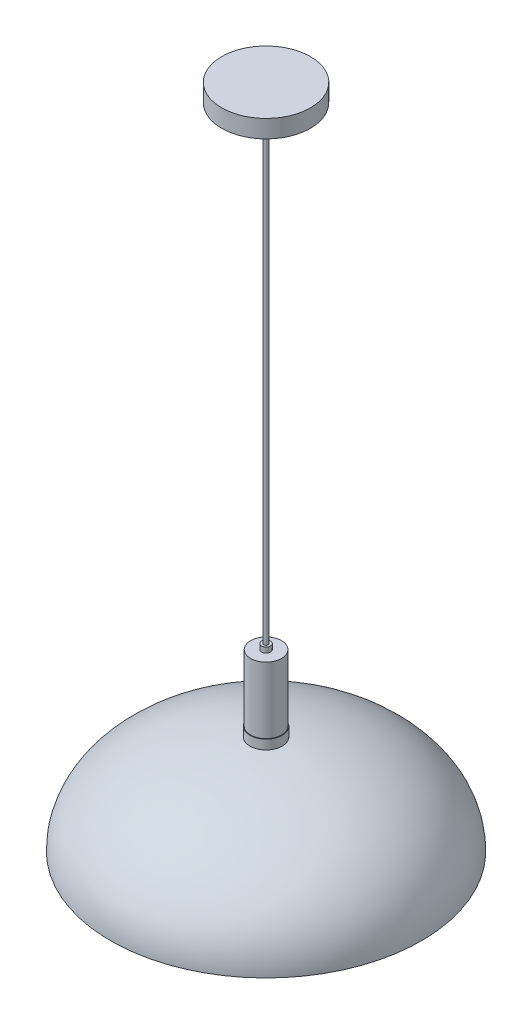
ISO-10303-21;
HEADER;
FILE_DESCRIPTION(('STEP AP214'),'2;1');
FILE_NAME('part.step','',(''),(''),'','','');
FILE_SCHEMA(('AUTOMOTIVE_DESIGN { 1 0 10303 214 1 1 1 1 }'));
ENDSEC;
DATA;
#1=APPLICATION_CONTEXT('core data for automotive mechanical design processes');
#2=APPLICATION_PROTOCOL_DEFINITION('international standard','automotive_design',2000,#1);
#3=PRODUCT_CONTEXT('',#1,'mechanical');
#4=PRODUCT('Part','Part','',(#3));
#5=PRODUCT_RELATED_PRODUCT_CATEGORY('part','',(#4));
#6=PRODUCT_DEFINITION_FORMATION('','',#4);
#7=PRODUCT_DEFINITION_CONTEXT('part definition',#1,'design');
#8=PRODUCT_DEFINITION('design','',#6,#7);
#9=PRODUCT_DEFINITION_SHAPE('','',#8);
#10=(LENGTH_UNIT() NAMED_UNIT(*) SI_UNIT(.MILLI.,.METRE.));
#11=(NAMED_UNIT(*) PLANE_ANGLE_UNIT() SI_UNIT($,.RADIAN.));
#12=(NAMED_UNIT(*) SI_UNIT($,.STERADIAN.) SOLID_ANGLE_UNIT());
#13=UNCERTAINTY_MEASURE_WITH_UNIT(LENGTH_MEASURE(1.E-05),#10,'distance_accuracy_value','');
#14=(GEOMETRIC_REPRESENTATION_CONTEXT(3) GLOBAL_UNCERTAINTY_ASSIGNED_CONTEXT((#13)) GLOBAL_UNIT_ASSIGNED_CONTEXT((#10,
#11,#12)) REPRESENTATION_CONTEXT('',''));
#15=CARTESIAN_POINT('',(0.,0.,0.));
#16=DIRECTION('',(0.,0.,1.));
#17=DIRECTION('',(1.,0.,0.));
#18=AXIS2_PLACEMENT_3D('',#15,#16,#17);
#19=CARTESIAN_POINT('',(0.,0.,0.));
#20=DIRECTION('',(0.,-1.,0.));
#21=DIRECTION('',(0.,0.,-1.));
#22=AXIS2_PLACEMENT_3D('',#19,#20,#21);
#23=PLANE('',#22);
#24=CARTESIAN_POINT('',(0.,0.,0.));
#25=DIRECTION('',(0.,-1.,0.));
#26=DIRECTION('',(0.,0.,-1.));
#27=AXIS2_PLACEMENT_3D('',#24,#25,#26);
#28=CIRCLE('',#27,172.);
#29=CARTESIAN_POINT('',(0.,0.,-172.));
#30=VERTEX_POINT('',#29);
#31=EDGE_CURVE('E94',#30,#30,#28,.T.);
#32=ORIENTED_EDGE('',*,*,#31,.F.);
#33=EDGE_LOOP('',(#32));
#34=FACE_BOUND('',#33,.T.);
#35=CARTESIAN_POINT('',(0.,0.,0.));
#36=DIRECTION('',(0.,-1.,0.));
#37=DIRECTION('',(0.,0.,-1.));
#38=AXIS2_PLACEMENT_3D('',#35,#36,#37);
#39=CIRCLE('',#38,175.);
#40=CARTESIAN_POINT('',(0.,0.,-175.));
#41=VERTEX_POINT('',#40);
#42=EDGE_CURVE('E85',#41,#41,#39,.T.);
#43=ORIENTED_EDGE('',*,*,#42,.T.);
#44=EDGE_LOOP('',(#43));
#45=FACE_BOUND('',#44,.T.);
#46=ADVANCED_FACE('F38',(#34,#45),#23,.T.);
#47=CARTESIAN_POINT('',(0.,750.,0.));
#48=DIRECTION('',(0.,1.,0.));
#49=DIRECTION('',(0.,0.,1.));
#50=AXIS2_PLACEMENT_3D('',#47,#48,#49);
#51=PLANE('',#50);
#52=CARTESIAN_POINT('',(0.,750.,0.));
#53=DIRECTION('',(0.,-1.,0.));
#54=DIRECTION('',(0.,0.,-1.));
#55=AXIS2_PLACEMENT_3D('',#52,#53,#54);
#56=CIRCLE('',#55,50.);
#57=CARTESIAN_POINT('',(0.,750.,-50.));
#58=VERTEX_POINT('',#57);
#59=EDGE_CURVE('E10',#58,#58,#56,.T.);
#60=ORIENTED_EDGE('',*,*,#59,.F.);
#61=EDGE_LOOP('',(#60));
#62=FACE_BOUND('',#61,.T.);
#63=ADVANCED_FACE('F141',(#62),#51,.T.);
#64=CARTESIAN_POINT('',(0.,0.,0.));
#65=DIRECTION('',(0.,-1.,0.));
#66=DIRECTION('',(0.,0.,-1.));
#67=AXIS2_PLACEMENT_3D('',#64,#65,#66);
#68=CYLINDRICAL_SURFACE('',#67,50.);
#69=ORIENTED_EDGE('',*,*,#59,.T.);
#70=EDGE_LOOP('',(#69));
#71=FACE_BOUND('',#70,.T.);
#72=CARTESIAN_POINT('',(0.,730.,0.));
#73=DIRECTION('',(0.,-1.,0.));
#74=DIRECTION('',(0.,0.,-1.));
#75=AXIS2_PLACEMENT_3D('',#72,#73,#74);
#76=CIRCLE('',#75,50.);
#77=CARTESIAN_POINT('',(0.,730.,-50.));
#78=VERTEX_POINT('',#77);
#79=EDGE_CURVE('E45',#78,#78,#76,.T.);
#80=ORIENTED_EDGE('',*,*,#79,.F.);
#81=EDGE_LOOP('',(#80));
#82=FACE_BOUND('',#81,.T.);
#83=ADVANCED_FACE('F139',(#71,#82),#68,.T.);
#84=CARTESIAN_POINT('',(2.500000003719,730.,0.));
#85=DIRECTION('',(0.,-1.,0.));
#86=DIRECTION('',(0.,0.,-1.));
#87=AXIS2_PLACEMENT_3D('',#84,#85,#86);
#88=PLANE('',#87);
#89=ORIENTED_EDGE('',*,*,#79,.T.);
#90=EDGE_LOOP('',(#89));
#91=FACE_BOUND('',#90,.T.);
#92=CARTESIAN_POINT('',(0.,730.,0.));
#93=DIRECTION('',(0.,-1.,0.));
#94=DIRECTION('',(0.,0.,-1.));
#95=AXIS2_PLACEMENT_3D('',#92,#93,#94);
#96=CIRCLE('',#95,2.500000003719);
#97=CARTESIAN_POINT('',(0.,730.,-2.500000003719));
#98=VERTEX_POINT('',#97);
#99=EDGE_CURVE('E50',#98,#98,#96,.T.);
#100=ORIENTED_EDGE('',*,*,#99,.F.);
#101=EDGE_LOOP('',(#100));
#102=FACE_BOUND('',#101,.T.);
#103=ADVANCED_FACE('F135',(#91,#102),#88,.T.);
#104=CARTESIAN_POINT('',(0.,0.,0.));
#105=DIRECTION('',(0.,-1.,0.));
#106=DIRECTION('',(0.,0.,-1.));
#107=AXIS2_PLACEMENT_3D('',#104,#105,#106);
#108=CYLINDRICAL_SURFACE('',#107,2.500000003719);
#109=ORIENTED_EDGE('',*,*,#99,.T.);
#110=EDGE_LOOP('',(#109));
#111=FACE_BOUND('',#110,.T.);
#112=CARTESIAN_POINT('',(0.,202.541423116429,0.));
#113=DIRECTION('',(0.,-1.,0.));
#114=DIRECTION('',(0.,0.,-1.));
#115=AXIS2_PLACEMENT_3D('',#112,#113,#114);
#116=CIRCLE('',#115,2.500000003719);
#117=CARTESIAN_POINT('',(0.,202.541423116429,-2.500000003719));
#118=VERTEX_POINT('',#117);
#119=EDGE_CURVE('E55',#118,#118,#116,.T.);
#120=ORIENTED_EDGE('',*,*,#119,.F.);
#121=EDGE_LOOP('',(#120));
#122=FACE_BOUND('',#121,.T.);
#123=ADVANCED_FACE('F131',(#111,#122),#108,.T.);
#124=CARTESIAN_POINT('',(5.000000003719,202.541423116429,0.));
#125=DIRECTION('',(0.,1.,0.));
#126=DIRECTION('',(0.,0.,1.));
#127=AXIS2_PLACEMENT_3D('',#124,#125,#126);
#128=PLANE('',#127);
#129=ORIENTED_EDGE('',*,*,#119,.T.);
#130=EDGE_LOOP('',(#129));
#131=FACE_BOUND('',#130,.T.);
#132=CARTESIAN_POINT('',(0.,202.541423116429,0.));
#133=DIRECTION('',(0.,-1.,0.));
#134=DIRECTION('',(0.,0.,-1.));
#135=AXIS2_PLACEMENT_3D('',#132,#133,#134);
#136=CIRCLE('',#135,5.000000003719);
#137=CARTESIAN_POINT('',(0.,202.541423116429,-5.000000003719));
#138=VERTEX_POINT('',#137);
#139=EDGE_CURVE('E61',#138,#138,#136,.T.);
#140=ORIENTED_EDGE('',*,*,#139,.F.);
#141=EDGE_LOOP('',(#140));
#142=FACE_BOUND('',#141,.T.);
#143=ADVANCED_FACE('F127',(#131,#142),#128,.T.);
#144=CARTESIAN_POINT('',(0.,0.,0.));
#145=DIRECTION('',(0.,-1.,0.));
#146=DIRECTION('',(0.,0.,-1.));
#147=AXIS2_PLACEMENT_3D('',#144,#145,#146);
#148=CYLINDRICAL_SURFACE('',#147,5.000000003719);
#149=ORIENTED_EDGE('',*,*,#139,.T.);
#150=EDGE_LOOP('',(#149));
#151=FACE_BOUND('',#150,.T.);
#152=CARTESIAN_POINT('',(0.,196.639402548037,0.));
#153=DIRECTION('',(0.,-1.,0.));
#154=DIRECTION('',(0.,0.,-1.));
#155=AXIS2_PLACEMENT_3D('',#152,#153,#154);
#156=CIRCLE('',#155,5.000000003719);
#157=CARTESIAN_POINT('',(0.,196.639402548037,-5.000000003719));
#158=VERTEX_POINT('',#157);
#159=EDGE_CURVE('E65',#158,#158,#156,.T.);
#160=ORIENTED_EDGE('',*,*,#159,.F.);
#161=EDGE_LOOP('',(#160));
#162=FACE_BOUND('',#161,.T.);
#163=ADVANCED_FACE('F123',(#151,#162),#148,.T.);
#164=CARTESIAN_POINT('',(5.000000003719,196.639402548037,0.));
#165=DIRECTION('',(0.,1.,0.));
#166=DIRECTION('',(0.,0.,1.));
#167=AXIS2_PLACEMENT_3D('',#164,#165,#166);
#168=PLANE('',#167);
#169=ORIENTED_EDGE('',*,*,#159,.T.);
#170=EDGE_LOOP('',(#169));
#171=FACE_BOUND('',#170,.T.);
#172=CARTESIAN_POINT('',(0.,196.639402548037,0.));
#173=DIRECTION('',(0.,-1.,0.));
#174=DIRECTION('',(0.,0.,-1.));
#175=AXIS2_PLACEMENT_3D('',#172,#173,#174);
#176=CIRCLE('',#175,17.4059828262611);
#177=CARTESIAN_POINT('',(0.,196.639402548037,-17.4059828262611));
#178=VERTEX_POINT('',#177);
#179=EDGE_CURVE('E69',#178,#178,#176,.T.);
#180=ORIENTED_EDGE('',*,*,#179,.F.);
#181=EDGE_LOOP('',(#180));
#182=FACE_BOUND('',#181,.T.);
#183=ADVANCED_FACE('F119',(#171,#182),#168,.T.);
#184=CARTESIAN_POINT('',(0.,0.,0.));
#185=DIRECTION('',(0.,-1.,0.));
#186=DIRECTION('',(0.,0.,-1.));
#187=AXIS2_PLACEMENT_3D('',#184,#185,#186);
#188=CYLINDRICAL_SURFACE('',#187,17.4059828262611);
#189=ORIENTED_EDGE('',*,*,#179,.T.);
#190=EDGE_LOOP('',(#189));
#191=FACE_BOUND('',#190,.T.);
#192=CARTESIAN_POINT('',(0.,122.002230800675,0.));
#193=DIRECTION('',(0.,-1.,0.));
#194=DIRECTION('',(0.,0.,-1.));
#195=AXIS2_PLACEMENT_3D('',#192,#193,#194);
#196=CIRCLE('',#195,17.4059828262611);
#197=CARTESIAN_POINT('',(0.,122.002230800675,-17.4059828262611));
#198=VERTEX_POINT('',#197);
#199=EDGE_CURVE('E73',#198,#198,#196,.T.);
#200=ORIENTED_EDGE('',*,*,#199,.F.);
#201=EDGE_LOOP('',(#200));
#202=FACE_BOUND('',#201,.T.);
#203=ADVANCED_FACE('F115',(#191,#202),#188,.T.);
#204=CARTESIAN_POINT('',(17.4059828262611,122.002230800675,0.));
#205=DIRECTION('',(0.,1.,0.));
#206=DIRECTION('',(0.,0.,1.));
#207=AXIS2_PLACEMENT_3D('',#204,#205,#206);
#208=PLANE('',#207);
#209=ORIENTED_EDGE('',*,*,#199,.T.);
#210=EDGE_LOOP('',(#209));
#211=FACE_BOUND('',#210,.T.);
#212=CARTESIAN_POINT('',(0.,122.002230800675,0.));
#213=DIRECTION('',(0.,-1.,0.));
#214=DIRECTION('',(0.,0.,-1.));
#215=AXIS2_PLACEMENT_3D('',#212,#213,#214);
#216=CIRCLE('',#215,18.1246827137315);
#217=CARTESIAN_POINT('',(0.,122.002230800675,-18.1246827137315));
#218=VERTEX_POINT('',#217);
#219=EDGE_CURVE('E77',#218,#218,#216,.T.);
#220=ORIENTED_EDGE('',*,*,#219,.F.);
#221=EDGE_LOOP('',(#220));
#222=FACE_BOUND('',#221,.T.);
#223=ADVANCED_FACE('F111',(#211,#222),#208,.T.);
#224=CARTESIAN_POINT('',(0.,0.,0.));
#225=DIRECTION('',(0.,-1.,0.));
#226=DIRECTION('',(0.,0.,-1.));
#227=AXIS2_PLACEMENT_3D('',#224,#225,#226);
#228=CYLINDRICAL_SURFACE('',#227,18.1246827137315);
#229=ORIENTED_EDGE('',*,*,#219,.T.);
#230=EDGE_LOOP('',(#229));
#231=FACE_BOUND('',#230,.T.);
#232=CARTESIAN_POINT('',(0.,111.455132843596,0.));
#233=DIRECTION('',(0.,-1.,0.));
#234=DIRECTION('',(0.,0.,-1.));
#235=AXIS2_PLACEMENT_3D('',#232,#233,#234);
#236=CIRCLE('',#235,18.1246827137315);
#237=CARTESIAN_POINT('',(0.,111.455132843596,-18.1246827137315));
#238=VERTEX_POINT('',#237);
#239=EDGE_CURVE('E81',#238,#238,#236,.T.);
#240=ORIENTED_EDGE('',*,*,#239,.F.);
#241=EDGE_LOOP('',(#240));
#242=FACE_BOUND('',#241,.T.);
#243=ADVANCED_FACE('F106',(#231,#242),#228,.T.);
#244=CARTESIAN_POINT('',(175.,0.,0.));
#245=CARTESIAN_POINT('',(175.,55.0246886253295,0.));
#246=CARTESIAN_POINT('',(120.313960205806,94.2682568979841,0.));
#247=CARTESIAN_POINT('',(61.4770682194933,108.343218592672,0.));
#248=CARTESIAN_POINT('',(18.1246827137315,111.455132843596,0.));
#249=CARTESIAN_POINT('',(17.4283809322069,111.505114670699,0.));
#250=CARTESIAN_POINT('',(16.7320791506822,111.555096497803,0.));
#251=CARTESIAN_POINT('',(16.0357773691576,111.605078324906,0.));
#252=CARTESIAN_POINT('',(15.339475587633,111.65506015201,0.));
#253=B_SPLINE_CURVE_WITH_KNOTS('',4,(#244,#245,#246,#247,#248,#249,#250,#251,#252),
.UNSPECIFIED.,.F.,.F.,(5,4,5),(0.,1.,1.0160614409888),.UNSPECIFIED.);
#254=CARTESIAN_POINT('',(0.,0.,0.));
#255=DIRECTION('',(0.,-1.,0.));
#256=AXIS1_PLACEMENT('',#254,#255);
#257=SURFACE_OF_REVOLUTION('',#253,#256);
#258=ORIENTED_EDGE('',*,*,#239,.T.);
#259=EDGE_LOOP('',(#258));
#260=FACE_BOUND('',#259,.T.);
#261=ORIENTED_EDGE('',*,*,#42,.F.);
#262=EDGE_LOOP('',(#261));
#263=FACE_BOUND('',#262,.T.);
#264=ADVANCED_FACE('F100',(#260,#263),#257,.F.);
#265=CARTESIAN_POINT('',(175.,0.,0.));
#266=CARTESIAN_POINT('',(175.,55.0246886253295,0.));
#267=CARTESIAN_POINT('',(120.313960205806,94.2682568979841,0.));
#268=CARTESIAN_POINT('',(61.4770682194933,108.343218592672,0.));
#269=CARTESIAN_POINT('',(17.4283809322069,111.505114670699,0.));
#270=CARTESIAN_POINT('',(16.7320791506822,111.555096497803,0.));
#271=CARTESIAN_POINT('',(16.0357773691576,111.605078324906,0.));
#272=CARTESIAN_POINT('',(15.339475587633,111.65506015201,0.));
#273=B_SPLINE_CURVE_WITH_KNOTS('',4,(#265,#266,#267,#268,#269,#270,#271,#272),.UNSPECIFIED.,.F.,
.F.,(5,3,5),(0.,1.,1.0160614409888),.UNSPECIFIED.);
#274=CARTESIAN_POINT('',(0.,0.,0.));
#275=DIRECTION('',(0.,-1.,0.));
#276=AXIS1_PLACEMENT('',#274,#275);
#277=SURFACE_OF_REVOLUTION('',#273,#276);
#278=OFFSET_SURFACE('',#277,3.,.F.);
#279=CARTESIAN_POINT('',(0.,108.662759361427,0.));
#280=DIRECTION('',(0.,-1.,0.));
#281=DIRECTION('',(0.,0.,-1.));
#282=AXIS2_PLACEMENT_3D('',#279,#280,#281);
#283=CIRCLE('',#282,15.1246827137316);
#284=CARTESIAN_POINT('',(0.,108.662759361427,-15.1246827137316));
#285=VERTEX_POINT('',#284);
#286=EDGE_CURVE('E157',#285,#285,#283,.T.);
#287=ORIENTED_EDGE('',*,*,#286,.F.);
#288=EDGE_LOOP('',(#287));
#289=FACE_BOUND('',#288,.T.);
#290=ORIENTED_EDGE('',*,*,#31,.T.);
#291=EDGE_LOOP('',(#290));
#292=FACE_BOUND('',#291,.T.);
#293=ADVANCED_FACE('F105',(#289,#292),#278,.T.);
#294=CARTESIAN_POINT('',(0.,0.,0.));
#295=DIRECTION('',(0.,-1.,0.));
#296=DIRECTION('',(0.,0.,-1.));
#297=AXIS2_PLACEMENT_3D('',#294,#295,#296);
#298=CYLINDRICAL_SURFACE('',#297,15.1246827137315);
#299=CARTESIAN_POINT('',(0.,119.002230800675,0.));
#300=DIRECTION('',(0.,1.,0.));
#301=DIRECTION('',(0.,0.,1.));
#302=AXIS2_PLACEMENT_3D('',#299,#300,#301);
#303=CIRCLE('',#302,15.1246827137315);
#304=CARTESIAN_POINT('',(0.,119.002230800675,15.1246827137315));
#305=VERTEX_POINT('',#304);
#306=EDGE_CURVE('E160',#305,#305,#303,.F.);
#307=ORIENTED_EDGE('',*,*,#306,.F.);
#308=EDGE_LOOP('',(#307));
#309=FACE_BOUND('',#308,.T.);
#310=ORIENTED_EDGE('',*,*,#286,.T.);
#311=EDGE_LOOP('',(#310));
#312=FACE_BOUND('',#311,.T.);
#313=ADVANCED_FACE('F269',(#309,#312),#298,.F.);
#314=CARTESIAN_POINT('',(17.4059828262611,119.002230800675,0.));
#315=DIRECTION('',(0.,1.,0.));
#316=DIRECTION('',(0.,0.,1.));
#317=AXIS2_PLACEMENT_3D('',#314,#315,#316);
#318=PLANE('',#317);
#319=CARTESIAN_POINT('',(0.,119.002230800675,0.));
#320=DIRECTION('',(0.,1.,0.));
#321=DIRECTION('',(0.,0.,1.));
#322=AXIS2_PLACEMENT_3D('',#319,#320,#321);
#323=CIRCLE('',#322,14.4059828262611);
#324=CARTESIAN_POINT('',(0.,119.002230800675,14.4059828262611));
#325=VERTEX_POINT('',#324);
#326=EDGE_CURVE('E165',#325,#325,#323,.F.);
#327=ORIENTED_EDGE('',*,*,#326,.F.);
#328=EDGE_LOOP('',(#327));
#329=FACE_BOUND('',#328,.T.);
#330=ORIENTED_EDGE('',*,*,#306,.T.);
#331=EDGE_LOOP('',(#330));
#332=FACE_BOUND('',#331,.T.);
#333=ADVANCED_FACE('F260',(#329,#332),#318,.F.);
#334=CARTESIAN_POINT('',(0.,0.,0.));
#335=DIRECTION('',(0.,-1.,0.));
#336=DIRECTION('',(0.,0.,-1.));
#337=AXIS2_PLACEMENT_3D('',#334,#335,#336);
#338=CYLINDRICAL_SURFACE('',#337,14.4059828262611);
#339=CARTESIAN_POINT('',(0.,193.639402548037,0.));
#340=DIRECTION('',(0.,1.,0.));
#341=DIRECTION('',(0.,0.,1.));
#342=AXIS2_PLACEMENT_3D('',#339,#340,#341);
#343=CIRCLE('',#342,14.4059828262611);
#344=CARTESIAN_POINT('',(0.,193.639402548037,14.4059828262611));
#345=VERTEX_POINT('',#344);
#346=EDGE_CURVE('E171',#345,#345,#343,.F.);
#347=ORIENTED_EDGE('',*,*,#346,.F.);
#348=EDGE_LOOP('',(#347));
#349=FACE_BOUND('',#348,.T.);
#350=ORIENTED_EDGE('',*,*,#326,.T.);
#351=EDGE_LOOP('',(#350));
#352=FACE_BOUND('',#351,.T.);
#353=ADVANCED_FACE('F251',(#349,#352),#338,.F.);
#354=CARTESIAN_POINT('',(5.000000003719,193.639402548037,0.));
#355=DIRECTION('',(0.,1.,0.));
#356=DIRECTION('',(0.,0.,1.));
#357=AXIS2_PLACEMENT_3D('',#354,#355,#356);
#358=PLANE('',#357);
#359=CARTESIAN_POINT('',(0.,193.639402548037,0.));
#360=DIRECTION('',(0.,1.,0.));
#361=DIRECTION('',(0.,0.,1.));
#362=AXIS2_PLACEMENT_3D('',#359,#360,#361);
#363=CIRCLE('',#362,2.000000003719);
#364=CARTESIAN_POINT('',(0.,193.639402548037,2.000000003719));
#365=VERTEX_POINT('',#364);
#366=EDGE_CURVE('E175',#365,#365,#363,.F.);
#367=ORIENTED_EDGE('',*,*,#366,.F.);
#368=EDGE_LOOP('',(#367));
#369=FACE_BOUND('',#368,.T.);
#370=ORIENTED_EDGE('',*,*,#346,.T.);
#371=EDGE_LOOP('',(#370));
#372=FACE_BOUND('',#371,.T.);
#373=ADVANCED_FACE('F242',(#369,#372),#358,.F.);
#374=CARTESIAN_POINT('',(0.,0.,0.));
#375=DIRECTION('',(0.,-1.,0.));
#376=DIRECTION('',(0.,0.,-1.));
#377=AXIS2_PLACEMENT_3D('',#374,#375,#376);
#378=CYLINDRICAL_SURFACE('',#377,2.000000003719);
#379=CARTESIAN_POINT('',(0.,199.541423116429,0.));
#380=DIRECTION('',(0.,1.,0.));
#381=DIRECTION('',(0.,0.,1.));
#382=AXIS2_PLACEMENT_3D('',#379,#380,#381);
#383=CIRCLE('',#382,2.000000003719);
#384=CARTESIAN_POINT('',(0.,199.541423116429,2.000000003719));
#385=VERTEX_POINT('',#384);
#386=EDGE_CURVE('E179',#385,#385,#383,.F.);
#387=ORIENTED_EDGE('',*,*,#386,.F.);
#388=EDGE_LOOP('',(#387));
#389=FACE_BOUND('',#388,.T.);
#390=ORIENTED_EDGE('',*,*,#366,.T.);
#391=EDGE_LOOP('',(#390));
#392=FACE_BOUND('',#391,.T.);
#393=ADVANCED_FACE('F235',(#389,#392),#378,.F.);
#394=CARTESIAN_POINT('',(5.000000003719,199.541423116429,0.));
#395=DIRECTION('',(0.,1.,0.));
#396=DIRECTION('',(0.,0.,1.));
#397=AXIS2_PLACEMENT_3D('',#394,#395,#396);
#398=PLANE('',#397);
#399=ORIENTED_EDGE('',*,*,#386,.T.);
#400=EDGE_LOOP('',(#399));
#401=FACE_BOUND('',#400,.T.);
#402=ADVANCED_FACE('F216',(#401),#398,.F.);
#403=CLOSED_SHELL('',(#46,#63,#83,#103,#123,#143,#163,#183,#203,#223,#243,#264,#293,#313,#333,
#353,#373,#393,#402));
#404=CARTESIAN_POINT('',(0.,747.,0.));
#405=DIRECTION('',(0.,1.,0.));
#406=DIRECTION('',(0.,0.,1.));
#407=AXIS2_PLACEMENT_3D('',#404,#405,#406);
#408=PLANE('',#407);
#409=CARTESIAN_POINT('',(0.,747.,0.));
#410=DIRECTION('',(0.,1.,0.));
#411=DIRECTION('',(0.,0.,1.));
#412=AXIS2_PLACEMENT_3D('',#409,#410,#411);
#413=CIRCLE('',#412,47.);
#414=CARTESIAN_POINT('',(0.,747.,47.));
#415=VERTEX_POINT('',#414);
#416=EDGE_CURVE('E89',#415,#415,#413,.F.);
#417=ORIENTED_EDGE('',*,*,#416,.T.);
#418=EDGE_LOOP('',(#417));
#419=FACE_BOUND('',#418,.T.);
#420=ADVANCED_FACE('F191',(#419),#408,.F.);
#421=CARTESIAN_POINT('',(0.,0.,0.));
#422=DIRECTION('',(0.,-1.,0.));
#423=DIRECTION('',(0.,0.,-1.));
#424=AXIS2_PLACEMENT_3D('',#421,#422,#423);
#425=CYLINDRICAL_SURFACE('',#424,47.);
#426=ORIENTED_EDGE('',*,*,#416,.F.);
#427=EDGE_LOOP('',(#426));
#428=FACE_BOUND('',#427,.T.);
#429=CARTESIAN_POINT('',(0.,733.,0.));
#430=DIRECTION('',(0.,-1.,0.));
#431=DIRECTION('',(0.,0.,-1.));
#432=AXIS2_PLACEMENT_3D('',#429,#430,#431);
#433=CIRCLE('',#432,47.);
#434=CARTESIAN_POINT('',(0.,733.,-47.));
#435=VERTEX_POINT('',#434);
#436=EDGE_CURVE('E183',#435,#435,#433,.T.);
#437=ORIENTED_EDGE('',*,*,#436,.T.);
#438=EDGE_LOOP('',(#437));
#439=FACE_BOUND('',#438,.T.);
#440=ADVANCED_FACE('F193',(#428,#439),#425,.F.);
#441=CARTESIAN_POINT('',(2.500000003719,733.,0.));
#442=DIRECTION('',(0.,-1.,0.));
#443=DIRECTION('',(0.,0.,-1.));
#444=AXIS2_PLACEMENT_3D('',#441,#442,#443);
#445=PLANE('',#444);
#446=ORIENTED_EDGE('',*,*,#436,.F.);
#447=EDGE_LOOP('',(#446));
#448=FACE_BOUND('',#447,.T.);
#449=ADVANCED_FACE('F196',(#448),#445,.F.);
#450=CLOSED_SHELL('',(#420,#440,#449));
#451=ORIENTED_CLOSED_SHELL('',*,#450,.T.);
#452=BREP_WITH_VOIDS('B2',#403,(#451));
#453=ADVANCED_BREP_SHAPE_REPRESENTATION('',(#18,#452),#14);
#454=SHAPE_DEFINITION_REPRESENTATION(#9,#453);
ENDSEC;
END-ISO-10303-21;
